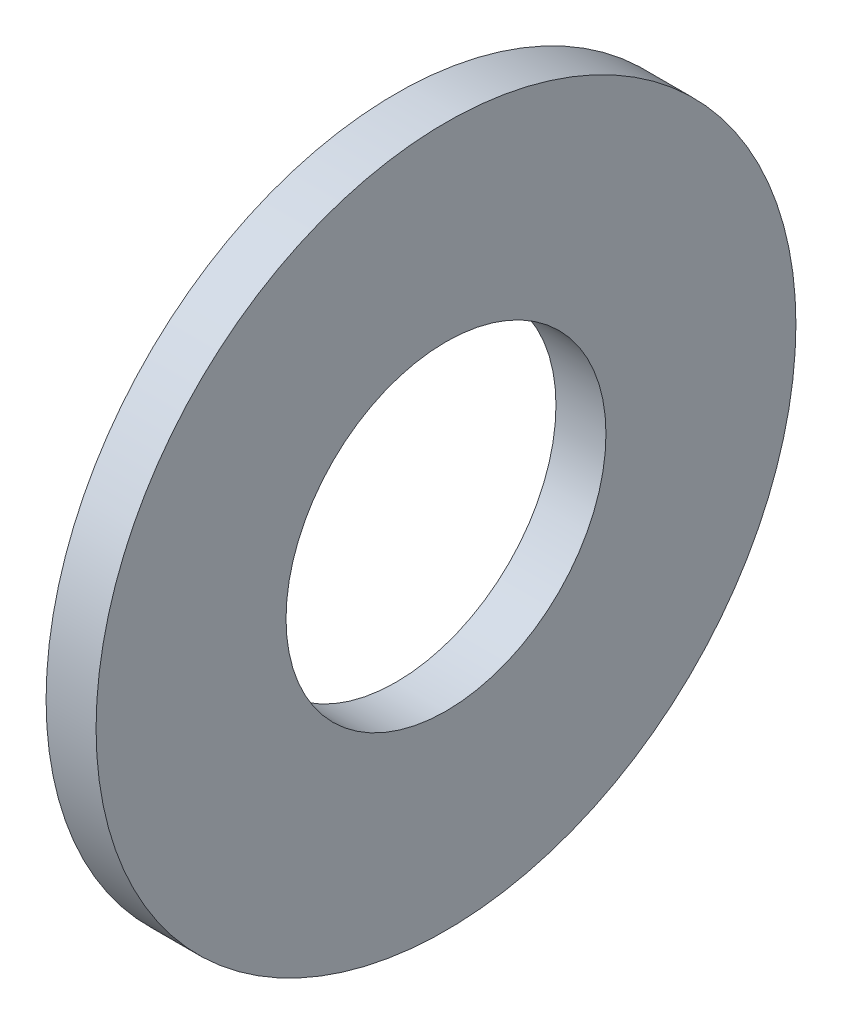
from build123d import *

# Parameters (mm, degrees)
ESQUISSE1_W = 1
ESQUISSE1_H = 3.8


with BuildPart() as part:
    # Esquisse1 → R_volution1 (revolve)
    with BuildSketch(Plane.XY, mode=Mode.PRIVATE) as r_volution1_sk:
        with Locations((6.5, 5.1)):
            Rectangle(ESQUISSE1_W, ESQUISSE1_H)
    revolve(r_volution1_sk.sketch.rotate(Axis((0, 0, 0), (1, 0, 0)), 90), axis=Axis((0, 0, 0), (1, 0, 0)))


solid = part.part
